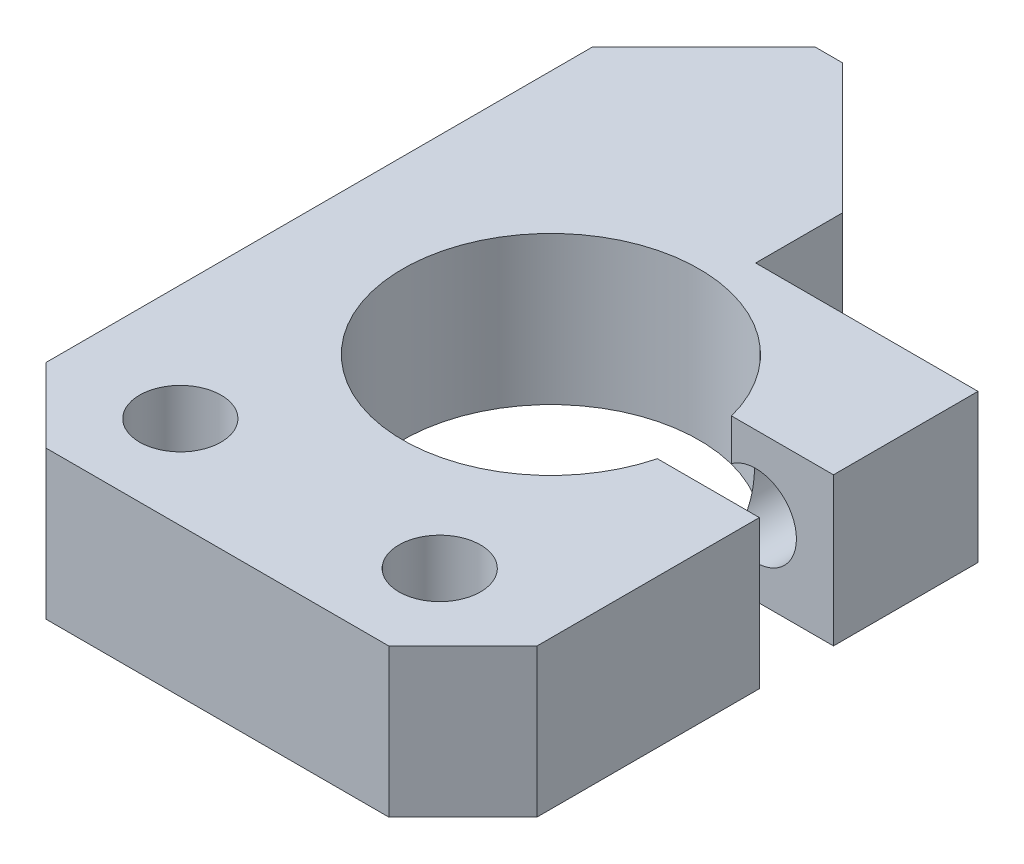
from build123d import *

# Parameters (mm, degrees)
SKETCH1_R                 = 1.1
BOSS_EXTRUDE1_DEPTH       = 4
F_2_0MM_DOWEL_HOLE1_D     = 2.2
F_2_0MM_DOWEL_HOLE1_DEPTH = 3.9
M2X0_4_TAPPED_HOLE1_D     = 1.6
M2X0_4_TAPPED_HOLE1_DEPTH = 4
M2X0_4_TAPPED_HOLE1_TIP   = 0.480688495


with BuildPart() as part:
    # Sketch1 → Boss-Extrude1 (new body)
    with BuildSketch(Plane(origin=(0, 0, 0), x_dir=(1, 0, 0), z_dir=(0, 1, 0))):
        with BuildLine():
            Line((4.625, -9), (-4.625, -9))
            Line((-4.625, -9), (-6.625, -7))
            Line((-6.625, -7), (-6.625, 7.75))
            Line((-6.625, 7.75), (-3.625, 10.75))
            Line((-3.625, 10.75), (-2.875, 10.75))
            Line((-2.875, 10.75), (0.625, 7.25))
            Line((0.625, 7.25), (0.625, 4.9))
            Line((0.625, 4.9), (6.625, 4.9))
            Line((6.625, 4.9), (6.625, 1))
            Line((6.625, 1), (3.872983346, 1))
            ThreePointArc((3.872983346, 1), (-4, 0), (3.872983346, -1))
            Line((3.872983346, -1), (6.625, -1))
            Line((6.625, -1), (6.625, -7))
            Line((6.625, -7), (4.625, -9))
        make_face()
        with Locations(Location((-3.5, -6.5, 0), (0, 0, 270))):
            Circle(SKETCH1_R, mode=Mode.SUBTRACT)
        with Locations(Location((3.5, -6.5, 0), (0, 0, 270))):
            Circle(SKETCH1_R, mode=Mode.SUBTRACT)
    extrude(amount=BOSS_EXTRUDE1_DEPTH)

    # 2.0mm Dowel Hole1
    with Locations(Plane(origin=(4.525, 2, -4.9), x_dir=(-1, 0, 0), z_dir=(0, 0, -1))):
        with Locations((0, 0)):
            Hole(F_2_0MM_DOWEL_HOLE1_D / 2, depth=F_2_0MM_DOWEL_HOLE1_DEPTH)

    # M2x0.4 Tapped Hole1
    with Locations(Plane(origin=(4.525, 2, 1), x_dir=(-1, 0, 0), z_dir=(0, 0, -1))):
        with Locations((0, 0)):
            Hole(M2X0_4_TAPPED_HOLE1_D / 2, depth=M2X0_4_TAPPED_HOLE1_DEPTH)
            with Locations((0, 0, -(M2X0_4_TAPPED_HOLE1_DEPTH + M2X0_4_TAPPED_HOLE1_TIP / 2))):  # 118° drill point
                Cone(0, M2X0_4_TAPPED_HOLE1_D / 2, M2X0_4_TAPPED_HOLE1_TIP, mode=Mode.SUBTRACT)


solid = part.part
